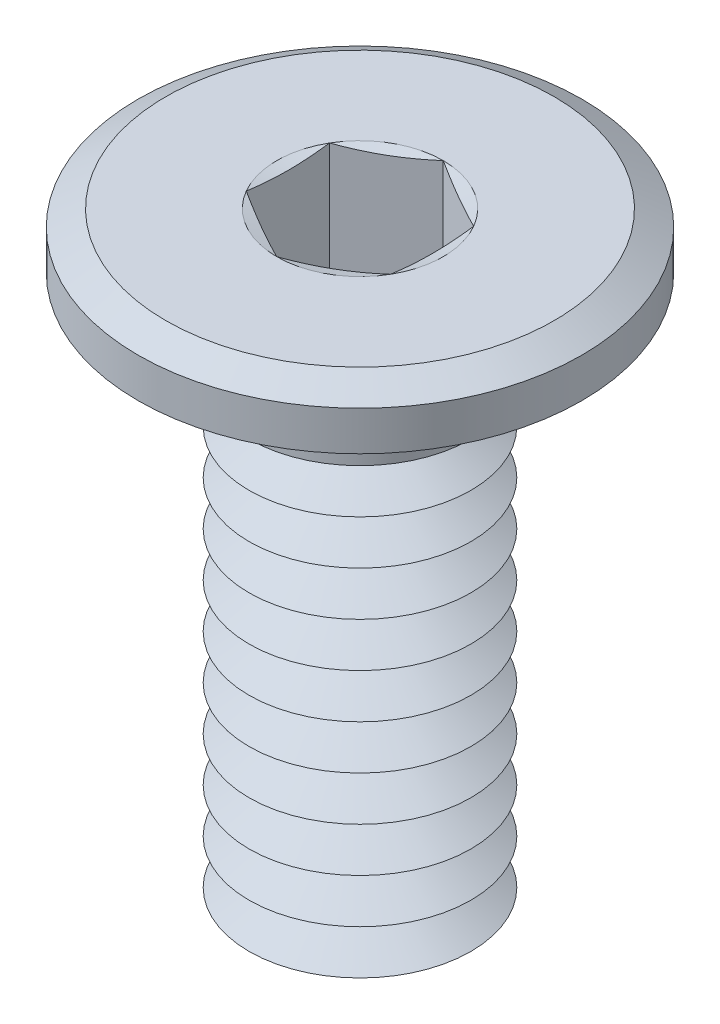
ISO-10303-21;
HEADER;
FILE_DESCRIPTION(('STEP AP214'),'2;1');
FILE_NAME('part.step','',(''),(''),'','','');
FILE_SCHEMA(('AUTOMOTIVE_DESIGN { 1 0 10303 214 1 1 1 1 }'));
ENDSEC;
DATA;
#1=APPLICATION_CONTEXT('core data for automotive mechanical design processes');
#2=APPLICATION_PROTOCOL_DEFINITION('international standard','automotive_design',2000,#1);
#3=PRODUCT_CONTEXT('',#1,'mechanical');
#4=PRODUCT('Part','Part','',(#3));
#5=PRODUCT_RELATED_PRODUCT_CATEGORY('part','',(#4));
#6=PRODUCT_DEFINITION_FORMATION('','',#4);
#7=PRODUCT_DEFINITION_CONTEXT('part definition',#1,'design');
#8=PRODUCT_DEFINITION('design','',#6,#7);
#9=PRODUCT_DEFINITION_SHAPE('','',#8);
#10=(LENGTH_UNIT() NAMED_UNIT(*) SI_UNIT(.MILLI.,.METRE.));
#11=(NAMED_UNIT(*) PLANE_ANGLE_UNIT() SI_UNIT($,.RADIAN.));
#12=(NAMED_UNIT(*) SI_UNIT($,.STERADIAN.) SOLID_ANGLE_UNIT());
#13=UNCERTAINTY_MEASURE_WITH_UNIT(LENGTH_MEASURE(1.E-05),#10,'distance_accuracy_value','');
#14=(GEOMETRIC_REPRESENTATION_CONTEXT(3) GLOBAL_UNCERTAINTY_ASSIGNED_CONTEXT((#13)) GLOBAL_UNIT_ASSIGNED_CONTEXT((#10,
#11,#12)) REPRESENTATION_CONTEXT('',''));
#15=CARTESIAN_POINT('',(0.,0.,0.));
#16=DIRECTION('',(0.,0.,1.));
#17=DIRECTION('',(1.,0.,0.));
#18=AXIS2_PLACEMENT_3D('',#15,#16,#17);
#19=CARTESIAN_POINT('',(0.,-4.9,0.));
#20=DIRECTION('',(0.,-1.,0.));
#21=DIRECTION('',(0.,0.,-1.));
#22=AXIS2_PLACEMENT_3D('',#19,#20,#21);
#23=CONICAL_SURFACE('',#22,1.,1.0471975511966);
#24=CARTESIAN_POINT('',(0.,-4.7,0.));
#25=DIRECTION('',(0.,1.,0.));
#26=DIRECTION('',(0.,0.,1.));
#27=AXIS2_PLACEMENT_3D('',#24,#25,#26);
#28=CIRCLE('',#27,0.653589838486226);
#29=CARTESIAN_POINT('',(0.,-4.7,0.653589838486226));
#30=VERTEX_POINT('',#29);
#31=EDGE_CURVE('E440',#30,#30,#28,.T.);
#32=ORIENTED_EDGE('',*,*,#31,.F.);
#33=EDGE_LOOP('',(#32));
#34=FACE_BOUND('',#33,.T.);
#35=CARTESIAN_POINT('',(0.,-4.9,0.));
#36=DIRECTION('',(0.,1.,0.));
#37=DIRECTION('',(0.,0.,1.));
#38=AXIS2_PLACEMENT_3D('',#35,#36,#37);
#39=CIRCLE('',#38,1.);
#40=CARTESIAN_POINT('',(0.,-4.9,1.));
#41=VERTEX_POINT('',#40);
#42=EDGE_CURVE('E444',#41,#41,#39,.T.);
#43=ORIENTED_EDGE('',*,*,#42,.T.);
#44=EDGE_LOOP('',(#43));
#45=FACE_BOUND('',#44,.T.);
#46=ADVANCED_FACE('F39',(#34,#45),#23,.T.);
#47=CARTESIAN_POINT('',(0.,-4.7,0.));
#48=DIRECTION('',(0.,1.,0.));
#49=DIRECTION('',(0.,0.,1.));
#50=AXIS2_PLACEMENT_3D('',#47,#48,#49);
#51=CONICAL_SURFACE('',#50,0.653589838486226,1.0471975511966);
#52=CARTESIAN_POINT('',(0.,-4.5,0.));
#53=DIRECTION('',(0.,1.,0.));
#54=DIRECTION('',(0.,0.,1.));
#55=AXIS2_PLACEMENT_3D('',#52,#53,#54);
#56=CIRCLE('',#55,1.);
#57=CARTESIAN_POINT('',(0.,-4.5,1.));
#58=VERTEX_POINT('',#57);
#59=EDGE_CURVE('E436',#58,#58,#56,.T.);
#60=ORIENTED_EDGE('',*,*,#59,.F.);
#61=EDGE_LOOP('',(#60));
#62=FACE_BOUND('',#61,.T.);
#63=ORIENTED_EDGE('',*,*,#31,.T.);
#64=EDGE_LOOP('',(#63));
#65=FACE_BOUND('',#64,.T.);
#66=ADVANCED_FACE('F233',(#62,#65),#51,.T.);
#67=CARTESIAN_POINT('',(0.,-5.5,0.));
#68=DIRECTION('',(0.,-1.,0.));
#69=DIRECTION('',(0.,0.,-1.));
#70=AXIS2_PLACEMENT_3D('',#67,#68,#69);
#71=PLANE('',#70);
#72=CARTESIAN_POINT('',(0.,-5.5,0.));
#73=DIRECTION('',(0.,1.,0.));
#74=DIRECTION('',(0.,0.,1.));
#75=AXIS2_PLACEMENT_3D('',#72,#73,#74);
#76=CIRCLE('',#75,0.653589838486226);
#77=CARTESIAN_POINT('',(0.,-5.5,0.653589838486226));
#78=VERTEX_POINT('',#77);
#79=EDGE_CURVE('E299',#78,#78,#76,.T.);
#80=ORIENTED_EDGE('',*,*,#79,.F.);
#81=EDGE_LOOP('',(#80));
#82=FACE_BOUND('',#81,.T.);
#83=ADVANCED_FACE('F239',(#82),#71,.T.);
#84=CARTESIAN_POINT('',(0.,-5.5,0.));
#85=DIRECTION('',(0.,1.,0.));
#86=DIRECTION('',(0.,0.,1.));
#87=AXIS2_PLACEMENT_3D('',#84,#85,#86);
#88=CONICAL_SURFACE('',#87,0.653589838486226,1.0471975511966);
#89=CARTESIAN_POINT('',(0.,-5.3,0.));
#90=DIRECTION('',(0.,1.,0.));
#91=DIRECTION('',(0.,0.,1.));
#92=AXIS2_PLACEMENT_3D('',#89,#90,#91);
#93=CIRCLE('',#92,1.);
#94=CARTESIAN_POINT('',(0.,-5.3,1.));
#95=VERTEX_POINT('',#94);
#96=EDGE_CURVE('E452',#95,#95,#93,.T.);
#97=ORIENTED_EDGE('',*,*,#96,.F.);
#98=EDGE_LOOP('',(#97));
#99=FACE_BOUND('',#98,.T.);
#100=ORIENTED_EDGE('',*,*,#79,.T.);
#101=EDGE_LOOP('',(#100));
#102=FACE_BOUND('',#101,.T.);
#103=ADVANCED_FACE('F254',(#99,#102),#88,.T.);
#104=CARTESIAN_POINT('',(0.,-5.3,0.));
#105=DIRECTION('',(0.,-1.,0.));
#106=DIRECTION('',(0.,0.,-1.));
#107=AXIS2_PLACEMENT_3D('',#104,#105,#106);
#108=CONICAL_SURFACE('',#107,1.,1.0471975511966);
#109=CARTESIAN_POINT('',(0.,-5.1,0.));
#110=DIRECTION('',(0.,1.,0.));
#111=DIRECTION('',(0.,0.,1.));
#112=AXIS2_PLACEMENT_3D('',#109,#110,#111);
#113=CIRCLE('',#112,0.653589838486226);
#114=CARTESIAN_POINT('',(0.,-5.1,0.653589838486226));
#115=VERTEX_POINT('',#114);
#116=EDGE_CURVE('E448',#115,#115,#113,.T.);
#117=ORIENTED_EDGE('',*,*,#116,.F.);
#118=EDGE_LOOP('',(#117));
#119=FACE_BOUND('',#118,.T.);
#120=ORIENTED_EDGE('',*,*,#96,.T.);
#121=EDGE_LOOP('',(#120));
#122=FACE_BOUND('',#121,.T.);
#123=ADVANCED_FACE('F250',(#119,#122),#108,.T.);
#124=CARTESIAN_POINT('',(0.,-5.1,0.));
#125=DIRECTION('',(0.,1.,0.));
#126=DIRECTION('',(0.,0.,1.));
#127=AXIS2_PLACEMENT_3D('',#124,#125,#126);
#128=CONICAL_SURFACE('',#127,0.653589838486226,1.0471975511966);
#129=ORIENTED_EDGE('',*,*,#42,.F.);
#130=EDGE_LOOP('',(#129));
#131=FACE_BOUND('',#130,.T.);
#132=ORIENTED_EDGE('',*,*,#116,.T.);
#133=EDGE_LOOP('',(#132));
#134=FACE_BOUND('',#133,.T.);
#135=ADVANCED_FACE('F246',(#131,#134),#128,.T.);
#136=CARTESIAN_POINT('',(0.,-4.5,0.));
#137=DIRECTION('',(0.,-1.,0.));
#138=DIRECTION('',(0.,0.,-1.));
#139=AXIS2_PLACEMENT_3D('',#136,#137,#138);
#140=CONICAL_SURFACE('',#139,1.,1.0471975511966);
#141=CARTESIAN_POINT('',(0.,-4.3,0.));
#142=DIRECTION('',(0.,1.,0.));
#143=DIRECTION('',(0.,0.,1.));
#144=AXIS2_PLACEMENT_3D('',#141,#142,#143);
#145=CIRCLE('',#144,0.653589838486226);
#146=CARTESIAN_POINT('',(0.,-4.3,0.653589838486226));
#147=VERTEX_POINT('',#146);
#148=EDGE_CURVE('E432',#147,#147,#145,.T.);
#149=ORIENTED_EDGE('',*,*,#148,.F.);
#150=EDGE_LOOP('',(#149));
#151=FACE_BOUND('',#150,.T.);
#152=ORIENTED_EDGE('',*,*,#59,.T.);
#153=EDGE_LOOP('',(#152));
#154=FACE_BOUND('',#153,.T.);
#155=ADVANCED_FACE('F249',(#151,#154),#140,.T.);
#156=CARTESIAN_POINT('',(0.,-4.3,0.));
#157=DIRECTION('',(0.,1.,0.));
#158=DIRECTION('',(0.,0.,1.));
#159=AXIS2_PLACEMENT_3D('',#156,#157,#158);
#160=CONICAL_SURFACE('',#159,0.653589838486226,1.0471975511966);
#161=CARTESIAN_POINT('',(0.,-4.1,0.));
#162=DIRECTION('',(0.,1.,0.));
#163=DIRECTION('',(0.,0.,1.));
#164=AXIS2_PLACEMENT_3D('',#161,#162,#163);
#165=CIRCLE('',#164,1.);
#166=CARTESIAN_POINT('',(0.,-4.1,1.));
#167=VERTEX_POINT('',#166);
#168=EDGE_CURVE('E428',#167,#167,#165,.T.);
#169=ORIENTED_EDGE('',*,*,#168,.F.);
#170=EDGE_LOOP('',(#169));
#171=FACE_BOUND('',#170,.T.);
#172=ORIENTED_EDGE('',*,*,#148,.T.);
#173=EDGE_LOOP('',(#172));
#174=FACE_BOUND('',#173,.T.);
#175=ADVANCED_FACE('F673',(#171,#174),#160,.T.);
#176=CARTESIAN_POINT('',(0.,-4.1,0.));
#177=DIRECTION('',(0.,-1.,0.));
#178=DIRECTION('',(0.,0.,-1.));
#179=AXIS2_PLACEMENT_3D('',#176,#177,#178);
#180=CONICAL_SURFACE('',#179,1.,1.0471975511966);
#181=CARTESIAN_POINT('',(0.,-3.9,0.));
#182=DIRECTION('',(0.,1.,0.));
#183=DIRECTION('',(0.,0.,1.));
#184=AXIS2_PLACEMENT_3D('',#181,#182,#183);
#185=CIRCLE('',#184,0.653589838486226);
#186=CARTESIAN_POINT('',(0.,-3.9,0.653589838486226));
#187=VERTEX_POINT('',#186);
#188=EDGE_CURVE('E424',#187,#187,#185,.T.);
#189=ORIENTED_EDGE('',*,*,#188,.F.);
#190=EDGE_LOOP('',(#189));
#191=FACE_BOUND('',#190,.T.);
#192=ORIENTED_EDGE('',*,*,#168,.T.);
#193=EDGE_LOOP('',(#192));
#194=FACE_BOUND('',#193,.T.);
#195=ADVANCED_FACE('F664',(#191,#194),#180,.T.);
#196=CARTESIAN_POINT('',(0.,-3.9,0.));
#197=DIRECTION('',(0.,1.,0.));
#198=DIRECTION('',(0.,0.,1.));
#199=AXIS2_PLACEMENT_3D('',#196,#197,#198);
#200=CONICAL_SURFACE('',#199,0.653589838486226,1.0471975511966);
#201=CARTESIAN_POINT('',(0.,-3.7,0.));
#202=DIRECTION('',(0.,1.,0.));
#203=DIRECTION('',(0.,0.,1.));
#204=AXIS2_PLACEMENT_3D('',#201,#202,#203);
#205=CIRCLE('',#204,1.);
#206=CARTESIAN_POINT('',(0.,-3.7,1.));
#207=VERTEX_POINT('',#206);
#208=EDGE_CURVE('E421',#207,#207,#205,.T.);
#209=ORIENTED_EDGE('',*,*,#208,.F.);
#210=EDGE_LOOP('',(#209));
#211=FACE_BOUND('',#210,.T.);
#212=ORIENTED_EDGE('',*,*,#188,.T.);
#213=EDGE_LOOP('',(#212));
#214=FACE_BOUND('',#213,.T.);
#215=ADVANCED_FACE('F655',(#211,#214),#200,.T.);
#216=CARTESIAN_POINT('',(0.,-3.7,0.));
#217=DIRECTION('',(0.,-1.,0.));
#218=DIRECTION('',(0.,0.,-1.));
#219=AXIS2_PLACEMENT_3D('',#216,#217,#218);
#220=CONICAL_SURFACE('',#219,1.,1.0471975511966);
#221=CARTESIAN_POINT('',(0.,-3.5,0.));
#222=DIRECTION('',(0.,1.,0.));
#223=DIRECTION('',(0.,0.,1.));
#224=AXIS2_PLACEMENT_3D('',#221,#222,#223);
#225=CIRCLE('',#224,0.653589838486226);
#226=CARTESIAN_POINT('',(0.,-3.5,0.653589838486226));
#227=VERTEX_POINT('',#226);
#228=EDGE_CURVE('E417',#227,#227,#225,.T.);
#229=ORIENTED_EDGE('',*,*,#228,.F.);
#230=EDGE_LOOP('',(#229));
#231=FACE_BOUND('',#230,.T.);
#232=ORIENTED_EDGE('',*,*,#208,.T.);
#233=EDGE_LOOP('',(#232));
#234=FACE_BOUND('',#233,.T.);
#235=ADVANCED_FACE('F646',(#231,#234),#220,.T.);
#236=CARTESIAN_POINT('',(0.,-3.5,0.));
#237=DIRECTION('',(0.,1.,0.));
#238=DIRECTION('',(0.,0.,1.));
#239=AXIS2_PLACEMENT_3D('',#236,#237,#238);
#240=CONICAL_SURFACE('',#239,0.653589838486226,1.0471975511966);
#241=CARTESIAN_POINT('',(0.,-3.3,0.));
#242=DIRECTION('',(0.,1.,0.));
#243=DIRECTION('',(0.,0.,1.));
#244=AXIS2_PLACEMENT_3D('',#241,#242,#243);
#245=CIRCLE('',#244,1.);
#246=CARTESIAN_POINT('',(0.,-3.3,1.));
#247=VERTEX_POINT('',#246);
#248=EDGE_CURVE('E414',#247,#247,#245,.T.);
#249=ORIENTED_EDGE('',*,*,#248,.F.);
#250=EDGE_LOOP('',(#249));
#251=FACE_BOUND('',#250,.T.);
#252=ORIENTED_EDGE('',*,*,#228,.T.);
#253=EDGE_LOOP('',(#252));
#254=FACE_BOUND('',#253,.T.);
#255=ADVANCED_FACE('F637',(#251,#254),#240,.T.);
#256=CARTESIAN_POINT('',(0.,-3.3,0.));
#257=DIRECTION('',(0.,-1.,0.));
#258=DIRECTION('',(0.,0.,-1.));
#259=AXIS2_PLACEMENT_3D('',#256,#257,#258);
#260=CONICAL_SURFACE('',#259,1.,1.0471975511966);
#261=CARTESIAN_POINT('',(0.,-3.1,0.));
#262=DIRECTION('',(0.,1.,0.));
#263=DIRECTION('',(0.,0.,1.));
#264=AXIS2_PLACEMENT_3D('',#261,#262,#263);
#265=CIRCLE('',#264,0.653589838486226);
#266=CARTESIAN_POINT('',(0.,-3.1,0.653589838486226));
#267=VERTEX_POINT('',#266);
#268=EDGE_CURVE('E410',#267,#267,#265,.T.);
#269=ORIENTED_EDGE('',*,*,#268,.F.);
#270=EDGE_LOOP('',(#269));
#271=FACE_BOUND('',#270,.T.);
#272=ORIENTED_EDGE('',*,*,#248,.T.);
#273=EDGE_LOOP('',(#272));
#274=FACE_BOUND('',#273,.T.);
#275=ADVANCED_FACE('F628',(#271,#274),#260,.T.);
#276=CARTESIAN_POINT('',(0.,-3.1,0.));
#277=DIRECTION('',(0.,1.,0.));
#278=DIRECTION('',(0.,0.,1.));
#279=AXIS2_PLACEMENT_3D('',#276,#277,#278);
#280=CONICAL_SURFACE('',#279,0.653589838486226,1.0471975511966);
#281=CARTESIAN_POINT('',(0.,-2.9,0.));
#282=DIRECTION('',(0.,1.,0.));
#283=DIRECTION('',(0.,0.,1.));
#284=AXIS2_PLACEMENT_3D('',#281,#282,#283);
#285=CIRCLE('',#284,1.);
#286=CARTESIAN_POINT('',(0.,-2.9,1.));
#287=VERTEX_POINT('',#286);
#288=EDGE_CURVE('E407',#287,#287,#285,.T.);
#289=ORIENTED_EDGE('',*,*,#288,.F.);
#290=EDGE_LOOP('',(#289));
#291=FACE_BOUND('',#290,.T.);
#292=ORIENTED_EDGE('',*,*,#268,.T.);
#293=EDGE_LOOP('',(#292));
#294=FACE_BOUND('',#293,.T.);
#295=ADVANCED_FACE('F619',(#291,#294),#280,.T.);
#296=CARTESIAN_POINT('',(0.,-2.9,0.));
#297=DIRECTION('',(0.,-1.,0.));
#298=DIRECTION('',(0.,0.,-1.));
#299=AXIS2_PLACEMENT_3D('',#296,#297,#298);
#300=CONICAL_SURFACE('',#299,1.,1.0471975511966);
#301=CARTESIAN_POINT('',(0.,-2.7,0.));
#302=DIRECTION('',(0.,1.,0.));
#303=DIRECTION('',(0.,0.,1.));
#304=AXIS2_PLACEMENT_3D('',#301,#302,#303);
#305=CIRCLE('',#304,0.653589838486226);
#306=CARTESIAN_POINT('',(0.,-2.7,0.653589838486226));
#307=VERTEX_POINT('',#306);
#308=EDGE_CURVE('E403',#307,#307,#305,.T.);
#309=ORIENTED_EDGE('',*,*,#308,.F.);
#310=EDGE_LOOP('',(#309));
#311=FACE_BOUND('',#310,.T.);
#312=ORIENTED_EDGE('',*,*,#288,.T.);
#313=EDGE_LOOP('',(#312));
#314=FACE_BOUND('',#313,.T.);
#315=ADVANCED_FACE('F610',(#311,#314),#300,.T.);
#316=CARTESIAN_POINT('',(0.,-2.7,0.));
#317=DIRECTION('',(0.,1.,0.));
#318=DIRECTION('',(0.,0.,1.));
#319=AXIS2_PLACEMENT_3D('',#316,#317,#318);
#320=CONICAL_SURFACE('',#319,0.653589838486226,1.0471975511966);
#321=CARTESIAN_POINT('',(0.,-2.5,0.));
#322=DIRECTION('',(0.,1.,0.));
#323=DIRECTION('',(0.,0.,1.));
#324=AXIS2_PLACEMENT_3D('',#321,#322,#323);
#325=CIRCLE('',#324,1.);
#326=CARTESIAN_POINT('',(0.,-2.5,1.));
#327=VERTEX_POINT('',#326);
#328=EDGE_CURVE('E399',#327,#327,#325,.T.);
#329=ORIENTED_EDGE('',*,*,#328,.F.);
#330=EDGE_LOOP('',(#329));
#331=FACE_BOUND('',#330,.T.);
#332=ORIENTED_EDGE('',*,*,#308,.T.);
#333=EDGE_LOOP('',(#332));
#334=FACE_BOUND('',#333,.T.);
#335=ADVANCED_FACE('F601',(#331,#334),#320,.T.);
#336=CARTESIAN_POINT('',(0.,-2.5,0.));
#337=DIRECTION('',(0.,-1.,0.));
#338=DIRECTION('',(0.,0.,-1.));
#339=AXIS2_PLACEMENT_3D('',#336,#337,#338);
#340=CONICAL_SURFACE('',#339,1.,1.0471975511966);
#341=CARTESIAN_POINT('',(0.,-2.3,0.));
#342=DIRECTION('',(0.,1.,0.));
#343=DIRECTION('',(0.,0.,1.));
#344=AXIS2_PLACEMENT_3D('',#341,#342,#343);
#345=CIRCLE('',#344,0.653589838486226);
#346=CARTESIAN_POINT('',(0.,-2.3,0.653589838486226));
#347=VERTEX_POINT('',#346);
#348=EDGE_CURVE('E396',#347,#347,#345,.T.);
#349=ORIENTED_EDGE('',*,*,#348,.F.);
#350=EDGE_LOOP('',(#349));
#351=FACE_BOUND('',#350,.T.);
#352=ORIENTED_EDGE('',*,*,#328,.T.);
#353=EDGE_LOOP('',(#352));
#354=FACE_BOUND('',#353,.T.);
#355=ADVANCED_FACE('F592',(#351,#354),#340,.T.);
#356=CARTESIAN_POINT('',(0.,-2.3,0.));
#357=DIRECTION('',(0.,1.,0.));
#358=DIRECTION('',(0.,0.,1.));
#359=AXIS2_PLACEMENT_3D('',#356,#357,#358);
#360=CONICAL_SURFACE('',#359,0.653589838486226,1.0471975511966);
#361=CARTESIAN_POINT('',(0.,-2.1,0.));
#362=DIRECTION('',(0.,1.,0.));
#363=DIRECTION('',(0.,0.,1.));
#364=AXIS2_PLACEMENT_3D('',#361,#362,#363);
#365=CIRCLE('',#364,1.);
#366=CARTESIAN_POINT('',(0.,-2.1,1.));
#367=VERTEX_POINT('',#366);
#368=EDGE_CURVE('E393',#367,#367,#365,.T.);
#369=ORIENTED_EDGE('',*,*,#368,.F.);
#370=EDGE_LOOP('',(#369));
#371=FACE_BOUND('',#370,.T.);
#372=ORIENTED_EDGE('',*,*,#348,.T.);
#373=EDGE_LOOP('',(#372));
#374=FACE_BOUND('',#373,.T.);
#375=ADVANCED_FACE('F583',(#371,#374),#360,.T.);
#376=CARTESIAN_POINT('',(0.,-2.1,0.));
#377=DIRECTION('',(0.,-1.,0.));
#378=DIRECTION('',(0.,0.,-1.));
#379=AXIS2_PLACEMENT_3D('',#376,#377,#378);
#380=CONICAL_SURFACE('',#379,1.,1.0471975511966);
#381=CARTESIAN_POINT('',(0.,-1.9,0.));
#382=DIRECTION('',(0.,1.,0.));
#383=DIRECTION('',(0.,0.,1.));
#384=AXIS2_PLACEMENT_3D('',#381,#382,#383);
#385=CIRCLE('',#384,0.653589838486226);
#386=CARTESIAN_POINT('',(0.,-1.9,0.653589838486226));
#387=VERTEX_POINT('',#386);
#388=EDGE_CURVE('E389',#387,#387,#385,.T.);
#389=ORIENTED_EDGE('',*,*,#388,.F.);
#390=EDGE_LOOP('',(#389));
#391=FACE_BOUND('',#390,.T.);
#392=ORIENTED_EDGE('',*,*,#368,.T.);
#393=EDGE_LOOP('',(#392));
#394=FACE_BOUND('',#393,.T.);
#395=ADVANCED_FACE('F574',(#391,#394),#380,.T.);
#396=CARTESIAN_POINT('',(0.,-1.9,0.));
#397=DIRECTION('',(0.,1.,0.));
#398=DIRECTION('',(0.,0.,1.));
#399=AXIS2_PLACEMENT_3D('',#396,#397,#398);
#400=CONICAL_SURFACE('',#399,0.653589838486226,1.0471975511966);
#401=CARTESIAN_POINT('',(0.,-1.7,0.));
#402=DIRECTION('',(0.,1.,0.));
#403=DIRECTION('',(0.,0.,1.));
#404=AXIS2_PLACEMENT_3D('',#401,#402,#403);
#405=CIRCLE('',#404,1.);
#406=CARTESIAN_POINT('',(0.,-1.7,1.));
#407=VERTEX_POINT('',#406);
#408=EDGE_CURVE('E385',#407,#407,#405,.T.);
#409=ORIENTED_EDGE('',*,*,#408,.F.);
#410=EDGE_LOOP('',(#409));
#411=FACE_BOUND('',#410,.T.);
#412=ORIENTED_EDGE('',*,*,#388,.T.);
#413=EDGE_LOOP('',(#412));
#414=FACE_BOUND('',#413,.T.);
#415=ADVANCED_FACE('F565',(#411,#414),#400,.T.);
#416=CARTESIAN_POINT('',(0.,-1.7,0.));
#417=DIRECTION('',(0.,-1.,0.));
#418=DIRECTION('',(0.,0.,-1.));
#419=AXIS2_PLACEMENT_3D('',#416,#417,#418);
#420=CONICAL_SURFACE('',#419,1.,1.0471975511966);
#421=CARTESIAN_POINT('',(0.,-1.5,0.));
#422=DIRECTION('',(0.,1.,0.));
#423=DIRECTION('',(0.,0.,1.));
#424=AXIS2_PLACEMENT_3D('',#421,#422,#423);
#425=CIRCLE('',#424,0.653589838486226);
#426=CARTESIAN_POINT('',(0.,-1.5,0.653589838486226));
#427=VERTEX_POINT('',#426);
#428=EDGE_CURVE('E381',#427,#427,#425,.T.);
#429=ORIENTED_EDGE('',*,*,#428,.F.);
#430=EDGE_LOOP('',(#429));
#431=FACE_BOUND('',#430,.T.);
#432=ORIENTED_EDGE('',*,*,#408,.T.);
#433=EDGE_LOOP('',(#432));
#434=FACE_BOUND('',#433,.T.);
#435=ADVANCED_FACE('F556',(#431,#434),#420,.T.);
#436=CARTESIAN_POINT('',(0.,-1.5,0.));
#437=DIRECTION('',(0.,1.,0.));
#438=DIRECTION('',(0.,0.,1.));
#439=AXIS2_PLACEMENT_3D('',#436,#437,#438);
#440=CONICAL_SURFACE('',#439,0.653589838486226,1.0471975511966);
#441=CARTESIAN_POINT('',(0.,-1.3,0.));
#442=DIRECTION('',(0.,1.,0.));
#443=DIRECTION('',(0.,0.,1.));
#444=AXIS2_PLACEMENT_3D('',#441,#442,#443);
#445=CIRCLE('',#444,1.);
#446=CARTESIAN_POINT('',(0.,-1.3,1.));
#447=VERTEX_POINT('',#446);
#448=EDGE_CURVE('E366',#447,#447,#445,.T.);
#449=ORIENTED_EDGE('',*,*,#448,.F.);
#450=EDGE_LOOP('',(#449));
#451=FACE_BOUND('',#450,.T.);
#452=ORIENTED_EDGE('',*,*,#428,.T.);
#453=EDGE_LOOP('',(#452));
#454=FACE_BOUND('',#453,.T.);
#455=ADVANCED_FACE('F274',(#451,#454),#440,.T.);
#456=CARTESIAN_POINT('',(0.,0.,0.));
#457=DIRECTION('',(0.,1.,0.));
#458=DIRECTION('',(0.,0.,1.));
#459=AXIS2_PLACEMENT_3D('',#456,#457,#458);
#460=PLANE('',#459);
#461=CARTESIAN_POINT('',(0.,0.,0.));
#462=DIRECTION('',(0.,1.,0.));
#463=DIRECTION('',(0.,0.,1.));
#464=AXIS2_PLACEMENT_3D('',#461,#462,#463);
#465=CIRCLE('',#464,0.750555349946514);
#466=CARTESIAN_POINT('',(0.,0.,0.750555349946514));
#467=VERTEX_POINT('',#466);
#468=CARTESIAN_POINT('',(0.65,0.,0.375277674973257));
#469=VERTEX_POINT('',#468);
#470=EDGE_CURVE('E66',#467,#469,#465,.T.);
#471=ORIENTED_EDGE('',*,*,#470,.F.);
#472=CARTESIAN_POINT('',(-0.65,0.,0.375277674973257));
#473=VERTEX_POINT('',#472);
#474=EDGE_CURVE('E169',#473,#467,#465,.T.);
#475=ORIENTED_EDGE('',*,*,#474,.F.);
#476=CARTESIAN_POINT('',(-0.65,0.,-0.375277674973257));
#477=VERTEX_POINT('',#476);
#478=EDGE_CURVE('E164',#477,#473,#465,.T.);
#479=ORIENTED_EDGE('',*,*,#478,.F.);
#480=CARTESIAN_POINT('',(0.,0.,-0.750555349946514));
#481=VERTEX_POINT('',#480);
#482=EDGE_CURVE('E128',#481,#477,#465,.T.);
#483=ORIENTED_EDGE('',*,*,#482,.F.);
#484=CARTESIAN_POINT('',(0.65,0.,-0.375277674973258));
#485=VERTEX_POINT('',#484);
#486=EDGE_CURVE('E119',#485,#481,#465,.T.);
#487=ORIENTED_EDGE('',*,*,#486,.F.);
#488=EDGE_CURVE('E59',#469,#485,#465,.T.);
#489=ORIENTED_EDGE('',*,*,#488,.F.);
#490=EDGE_LOOP('',(#471,#475,#479,#483,#487,#489));
#491=FACE_BOUND('',#490,.T.);
#492=CARTESIAN_POINT('',(0.,0.,0.));
#493=DIRECTION('',(0.,1.,0.));
#494=DIRECTION('',(0.,0.,1.));
#495=AXIS2_PLACEMENT_3D('',#492,#493,#494);
#496=CIRCLE('',#495,1.75);
#497=CARTESIAN_POINT('',(0.,0.,1.75));
#498=VERTEX_POINT('',#497);
#499=EDGE_CURVE('E295',#498,#498,#496,.T.);
#500=ORIENTED_EDGE('',*,*,#499,.T.);
#501=EDGE_LOOP('',(#500));
#502=FACE_BOUND('',#501,.T.);
#503=ADVANCED_FACE('F160',(#491,#502),#460,.T.);
#504=CARTESIAN_POINT('',(0.,-0.5,0.));
#505=DIRECTION('',(0.,1.,0.));
#506=DIRECTION('',(0.,0.,1.));
#507=AXIS2_PLACEMENT_3D('',#504,#505,#506);
#508=CYLINDRICAL_SURFACE('',#507,2.);
#509=CARTESIAN_POINT('',(0.,-0.144337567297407,0.));
#510=DIRECTION('',(0.,1.,0.));
#511=DIRECTION('',(0.,0.,1.));
#512=AXIS2_PLACEMENT_3D('',#509,#510,#511);
#513=CIRCLE('',#512,2.);
#514=CARTESIAN_POINT('',(0.,-0.144337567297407,2.));
#515=VERTEX_POINT('',#514);
#516=EDGE_CURVE('E306',#515,#515,#513,.F.);
#517=ORIENTED_EDGE('',*,*,#516,.T.);
#518=EDGE_LOOP('',(#517));
#519=FACE_BOUND('',#518,.T.);
#520=CARTESIAN_POINT('',(0.,-0.5,0.));
#521=DIRECTION('',(0.,1.,0.));
#522=DIRECTION('',(0.,0.,1.));
#523=AXIS2_PLACEMENT_3D('',#520,#521,#522);
#524=CIRCLE('',#523,2.);
#525=CARTESIAN_POINT('',(0.,-0.5,2.));
#526=VERTEX_POINT('',#525);
#527=EDGE_CURVE('E291',#526,#526,#524,.T.);
#528=ORIENTED_EDGE('',*,*,#527,.T.);
#529=EDGE_LOOP('',(#528));
#530=FACE_BOUND('',#529,.T.);
#531=ADVANCED_FACE('F270',(#519,#530),#508,.T.);
#532=CARTESIAN_POINT('',(0.,-0.5,0.));
#533=DIRECTION('',(0.,1.,0.));
#534=DIRECTION('',(0.,0.,1.));
#535=AXIS2_PLACEMENT_3D('',#532,#533,#534);
#536=PLANE('',#535);
#537=CARTESIAN_POINT('',(0.,-0.5,0.));
#538=DIRECTION('',(0.,1.,0.));
#539=DIRECTION('',(0.,0.,1.));
#540=AXIS2_PLACEMENT_3D('',#537,#538,#539);
#541=CIRCLE('',#540,1.1);
#542=CARTESIAN_POINT('',(0.,-0.5,1.1));
#543=VERTEX_POINT('',#542);
#544=EDGE_CURVE('E286',#543,#543,#541,.T.);
#545=ORIENTED_EDGE('',*,*,#544,.T.);
#546=EDGE_LOOP('',(#545));
#547=FACE_BOUND('',#546,.T.);
#548=ORIENTED_EDGE('',*,*,#527,.F.);
#549=EDGE_LOOP('',(#548));
#550=FACE_BOUND('',#549,.T.);
#551=ADVANCED_FACE('F266',(#547,#550),#536,.F.);
#552=CARTESIAN_POINT('',(0.,-5.5,0.));
#553=DIRECTION('',(0.,1.,0.));
#554=DIRECTION('',(0.,0.,1.));
#555=AXIS2_PLACEMENT_3D('',#552,#553,#554);
#556=CYLINDRICAL_SURFACE('',#555,1.);
#557=CARTESIAN_POINT('',(0.,-0.6,0.));
#558=DIRECTION('',(0.,1.,0.));
#559=DIRECTION('',(0.,0.,1.));
#560=AXIS2_PLACEMENT_3D('',#557,#558,#559);
#561=CIRCLE('',#560,1.);
#562=CARTESIAN_POINT('',(0.,-0.6,1.));
#563=VERTEX_POINT('',#562);
#564=EDGE_CURVE('E289',#563,#563,#561,.F.);
#565=ORIENTED_EDGE('',*,*,#564,.T.);
#566=EDGE_LOOP('',(#565));
#567=FACE_BOUND('',#566,.T.);
#568=ORIENTED_EDGE('',*,*,#448,.T.);
#569=EDGE_LOOP('',(#568));
#570=FACE_BOUND('',#569,.T.);
#571=ADVANCED_FACE('F262',(#567,#570),#556,.T.);
#572=CARTESIAN_POINT('',(0.,-0.6,0.));
#573=DIRECTION('',(0.,1.,0.));
#574=DIRECTION('',(0.,0.,1.));
#575=AXIS2_PLACEMENT_3D('',#572,#573,#574);
#576=TOROIDAL_SURFACE('',#575,1.1,0.1);
#577=ORIENTED_EDGE('',*,*,#544,.F.);
#578=EDGE_LOOP('',(#577));
#579=FACE_BOUND('',#578,.T.);
#580=ORIENTED_EDGE('',*,*,#564,.F.);
#581=EDGE_LOOP('',(#580));
#582=FACE_BOUND('',#581,.T.);
#583=ADVANCED_FACE('F265',(#579,#582),#576,.F.);
#584=CARTESIAN_POINT('',(0.,0.,0.));
#585=DIRECTION('',(0.,-1.,0.));
#586=DIRECTION('',(0.,0.,-1.));
#587=AXIS2_PLACEMENT_3D('',#584,#585,#586);
#588=CONICAL_SURFACE('',#587,1.75,1.0471975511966);
#589=ORIENTED_EDGE('',*,*,#516,.F.);
#590=EDGE_LOOP('',(#589));
#591=FACE_BOUND('',#590,.T.);
#592=ORIENTED_EDGE('',*,*,#499,.F.);
#593=EDGE_LOOP('',(#592));
#594=FACE_BOUND('',#593,.T.);
#595=ADVANCED_FACE('F41',(#591,#594),#588,.T.);
#596=CARTESIAN_POINT('',(0.,0.,0.));
#597=DIRECTION('',(0.,1.,0.));
#598=DIRECTION('',(0.,0.,1.));
#599=AXIS2_PLACEMENT_3D('',#596,#597,#598);
#600=CONICAL_SURFACE('',#599,0.750555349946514,1.30899693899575);
#601=ORIENTED_EDGE('',*,*,#482,.T.);
#602=CARTESIAN_POINT('',(0.000200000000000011,3.09472466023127E-05,-0.750670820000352));
#603=CARTESIAN_POINT('',(-0.0268094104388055,-0.00415092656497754,-0.735076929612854));
#604=CARTESIAN_POINT('',(-0.0538678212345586,-0.00794750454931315,-0.719454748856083));
#605=CARTESIAN_POINT('',(-0.108080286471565,-0.0146178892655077,-0.688155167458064));
#606=CARTESIAN_POINT('',(-0.135234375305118,-0.0174913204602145,-0.672477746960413));
#607=CARTESIAN_POINT('',(-0.18947340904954,-0.0221475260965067,-0.641162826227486));
#608=CARTESIAN_POINT('',(-0.216557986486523,-0.0239358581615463,-0.625525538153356));
#609=CARTESIAN_POINT('',(-0.270761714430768,-0.0263338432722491,-0.594231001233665));
#610=CARTESIAN_POINT('',(-0.297880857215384,-0.0269437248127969,-0.578573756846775));
#611=CARTESIAN_POINT('',(-0.352119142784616,-0.0269437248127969,-0.547259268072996));
#612=CARTESIAN_POINT('',(-0.379238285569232,-0.0263338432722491,-0.531602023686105));
#613=CARTESIAN_POINT('',(-0.433442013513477,-0.0239358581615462,-0.500307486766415));
#614=CARTESIAN_POINT('',(-0.460526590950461,-0.0221475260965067,-0.484670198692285));
#615=CARTESIAN_POINT('',(-0.514765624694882,-0.0174913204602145,-0.453355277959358));
#616=CARTESIAN_POINT('',(-0.541919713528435,-0.0146178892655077,-0.437677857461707));
#617=CARTESIAN_POINT('',(-0.596132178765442,-0.00794750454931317,-0.406378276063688));
#618=CARTESIAN_POINT('',(-0.623190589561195,-0.00415092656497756,-0.390756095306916));
#619=CARTESIAN_POINT('',(-0.6502,3.09472466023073E-05,-0.375162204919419));
#620=B_SPLINE_CURVE_WITH_KNOTS('',3,(#602,#603,#604,#605,#606,#607,#608,#609,#610,#611,#612,
#613,#614,#615,#616,#617,#618,#619),.UNSPECIFIED.,.F.,.F.,(4,2,2,2,2,2,2,2,4),(0.,
0.0944056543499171,0.188849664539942,0.282805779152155,0.376743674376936,0.470681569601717,
0.564637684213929,0.659081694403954,0.753487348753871),.UNSPECIFIED.);
#621=EDGE_CURVE('E11',#481,#477,#620,.T.);
#622=ORIENTED_EDGE('',*,*,#621,.F.);
#623=EDGE_LOOP('',(#601,#622));
#624=FACE_BOUND('',#623,.T.);
#625=ADVANCED_FACE('F132',(#624),#600,.F.);
#626=ORIENTED_EDGE('',*,*,#478,.T.);
#627=CARTESIAN_POINT('',(-0.65,0.153431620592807,-1.15250975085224));
#628=CARTESIAN_POINT('',(-0.65,0.140485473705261,-1.09696292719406));
#629=CARTESIAN_POINT('',(-0.65,0.12772104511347,-1.04137089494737));
#630=CARTESIAN_POINT('',(-0.65,0.102806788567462,-0.93003898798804));
#631=CARTESIAN_POINT('',(-0.65,0.0906570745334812,-0.874299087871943));
#632=CARTESIAN_POINT('',(-0.65,0.0671143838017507,-0.762091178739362));
#633=CARTESIAN_POINT('',(-0.65,0.0557299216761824,-0.70562136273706));
#634=CARTESIAN_POINT('',(-0.65,0.0342960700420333,-0.59241870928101));
#635=CARTESIAN_POINT('',(-0.65,0.0242468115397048,-0.535685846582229));
#636=CARTESIAN_POINT('',(-0.65,0.00641278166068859,-0.423455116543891));
#637=CARTESIAN_POINT('',(-0.65,-0.00142665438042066,-0.367966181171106));
#638=CARTESIAN_POINT('',(-0.65,-0.0143371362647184,-0.256669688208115));
#639=CARTESIAN_POINT('',(-0.65,-0.0194090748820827,-0.200862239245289));
#640=CARTESIAN_POINT('',(-0.65,-0.025908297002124,-0.0892782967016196));
#641=CARTESIAN_POINT('',(-0.65,-0.0273521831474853,-0.0335028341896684));
#642=CARTESIAN_POINT('',(-0.65,-0.0263311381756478,0.078014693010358));
#643=CARTESIAN_POINT('',(-0.65,-0.0238659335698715,0.133756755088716));
#644=CARTESIAN_POINT('',(-0.65,-0.016691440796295,0.229596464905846));
#645=CARTESIAN_POINT('',(-0.65,-0.0127907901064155,0.269759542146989));
#646=CARTESIAN_POINT('',(-0.65,-0.00354681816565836,0.349915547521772));
#647=CARTESIAN_POINT('',(-0.65,0.00179646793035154,0.389908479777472));
#648=CARTESIAN_POINT('',(-0.65,0.0195190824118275,0.50990254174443));
#649=CARTESIAN_POINT('',(-0.65,0.0335668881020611,0.589653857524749));
#650=CARTESIAN_POINT('',(-0.65,0.0566589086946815,0.709742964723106));
#651=CARTESIAN_POINT('',(-0.65,0.0647873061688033,0.750268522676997));
#652=CARTESIAN_POINT('',(-0.65,0.0815416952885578,0.831218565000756));
#653=CARTESIAN_POINT('',(-0.65,0.0901676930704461,0.871643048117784));
#654=CARTESIAN_POINT('',(-0.65,0.107740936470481,0.952178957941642));
#655=CARTESIAN_POINT('',(-0.65,0.116686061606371,0.992290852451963));
#656=CARTESIAN_POINT('',(-0.65,0.134863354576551,1.07244661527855));
#657=CARTESIAN_POINT('',(-0.65,0.144095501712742,1.11249048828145));
#658=CARTESIAN_POINT('',(-0.65,0.153431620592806,1.15250975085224));
#659=B_SPLINE_CURVE_WITH_KNOTS('',3,(#627,#628,#629,#630,#631,#632,#633,#634,#635,#636,#637,
#638,#639,#640,#641,#642,#643,#644,#645,#646,#647,#648,#649,#650,#651,#652,#653,#654,#655,#656,
#657,#658),.UNSPECIFIED.,.F.,.F.,(4,2,2,2,2,2,2,2,2,2,2,2,2,2,2,4),(0.,0.171110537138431,
0.342252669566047,0.515060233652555,0.687884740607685,0.855957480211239,1.02397596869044,
1.19122416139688,1.3584840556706,1.4795115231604,1.60053604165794,1.84338230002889,
1.9673809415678,2.09138111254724,2.21467179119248,2.33795359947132),.UNSPECIFIED.);
#660=EDGE_CURVE('E172',#477,#473,#659,.T.);
#661=ORIENTED_EDGE('',*,*,#660,.F.);
#662=EDGE_LOOP('',(#626,#661));
#663=FACE_BOUND('',#662,.T.);
#664=ADVANCED_FACE('F512',(#663),#600,.F.);
#665=ORIENTED_EDGE('',*,*,#474,.T.);
#666=CARTESIAN_POINT('',(-0.6502,3.09472466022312E-05,0.375162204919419));
#667=CARTESIAN_POINT('',(-0.623190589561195,-0.0041509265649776,0.390756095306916));
#668=CARTESIAN_POINT('',(-0.596132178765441,-0.00794750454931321,0.406378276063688));
#669=CARTESIAN_POINT('',(-0.541919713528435,-0.0146178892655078,0.437677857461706));
#670=CARTESIAN_POINT('',(-0.514765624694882,-0.0174913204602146,0.453355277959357));
#671=CARTESIAN_POINT('',(-0.460526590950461,-0.0221475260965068,0.484670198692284));
#672=CARTESIAN_POINT('',(-0.433442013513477,-0.0239358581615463,0.500307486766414));
#673=CARTESIAN_POINT('',(-0.379238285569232,-0.0263338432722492,0.531602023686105));
#674=CARTESIAN_POINT('',(-0.352119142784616,-0.026943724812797,0.547259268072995));
#675=CARTESIAN_POINT('',(-0.297880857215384,-0.026943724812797,0.578573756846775));
#676=CARTESIAN_POINT('',(-0.270761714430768,-0.0263338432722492,0.594231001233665));
#677=CARTESIAN_POINT('',(-0.216557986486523,-0.0239358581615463,0.625525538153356));
#678=CARTESIAN_POINT('',(-0.18947340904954,-0.0221475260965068,0.641162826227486));
#679=CARTESIAN_POINT('',(-0.135234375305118,-0.0174913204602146,0.672477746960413));
#680=CARTESIAN_POINT('',(-0.108080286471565,-0.0146178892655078,0.688155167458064));
#681=CARTESIAN_POINT('',(-0.0538678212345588,-0.00794750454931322,0.719454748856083));
#682=CARTESIAN_POINT('',(-0.0268094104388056,-0.0041509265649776,0.735076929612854));
#683=CARTESIAN_POINT('',(0.000199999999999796,3.09472466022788E-05,0.750670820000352));
#684=B_SPLINE_CURVE_WITH_KNOTS('',3,(#666,#667,#668,#669,#670,#671,#672,#673,#674,#675,#676,
#677,#678,#679,#680,#681,#682,#683),.UNSPECIFIED.,.F.,.F.,(4,2,2,2,2,2,2,2,4),(0.,
0.0944056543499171,0.188849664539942,0.282805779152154,0.376743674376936,0.470681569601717,
0.564637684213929,0.659081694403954,0.753487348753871),.UNSPECIFIED.);
#685=EDGE_CURVE('E180',#473,#467,#684,.T.);
#686=ORIENTED_EDGE('',*,*,#685,.F.);
#687=EDGE_LOOP('',(#665,#686));
#688=FACE_BOUND('',#687,.T.);
#689=ADVANCED_FACE('F507',(#688),#600,.F.);
#690=ORIENTED_EDGE('',*,*,#470,.T.);
#691=CARTESIAN_POINT('',(-0.000200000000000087,3.09472466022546E-05,0.750670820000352));
#692=CARTESIAN_POINT('',(0.0268094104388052,-0.00415092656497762,0.735076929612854));
#693=CARTESIAN_POINT('',(0.0538678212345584,-0.00794750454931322,0.719454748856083));
#694=CARTESIAN_POINT('',(0.108080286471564,-0.0146178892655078,0.688155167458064));
#695=CARTESIAN_POINT('',(0.135234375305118,-0.0174913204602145,0.672477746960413));
#696=CARTESIAN_POINT('',(0.189473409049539,-0.0221475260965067,0.641162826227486));
#697=CARTESIAN_POINT('',(0.216557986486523,-0.0239358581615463,0.625525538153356));
#698=CARTESIAN_POINT('',(0.270761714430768,-0.0263338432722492,0.594231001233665));
#699=CARTESIAN_POINT('',(0.297880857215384,-0.0269437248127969,0.578573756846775));
#700=CARTESIAN_POINT('',(0.352119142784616,-0.0269437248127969,0.547259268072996));
#701=CARTESIAN_POINT('',(0.379238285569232,-0.0263338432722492,0.531602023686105));
#702=CARTESIAN_POINT('',(0.433442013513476,-0.0239358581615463,0.500307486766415));
#703=CARTESIAN_POINT('',(0.46052659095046,-0.0221475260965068,0.484670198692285));
#704=CARTESIAN_POINT('',(0.514765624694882,-0.0174913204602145,0.453355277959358));
#705=CARTESIAN_POINT('',(0.541919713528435,-0.0146178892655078,0.437677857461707));
#706=CARTESIAN_POINT('',(0.596132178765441,-0.00794750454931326,0.406378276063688));
#707=CARTESIAN_POINT('',(0.623190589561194,-0.00415092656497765,0.390756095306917));
#708=CARTESIAN_POINT('',(0.6502,3.09472466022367E-05,0.375162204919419));
#709=B_SPLINE_CURVE_WITH_KNOTS('',3,(#691,#692,#693,#694,#695,#696,#697,#698,#699,#700,#701,
#702,#703,#704,#705,#706,#707,#708),.UNSPECIFIED.,.F.,.F.,(4,2,2,2,2,2,2,2,4),(0.,
0.0944056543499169,0.188849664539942,0.282805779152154,0.376743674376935,0.470681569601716,
0.564637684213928,0.659081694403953,0.753487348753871),.UNSPECIFIED.);
#710=EDGE_CURVE('E199',#467,#469,#709,.T.);
#711=ORIENTED_EDGE('',*,*,#710,.F.);
#712=EDGE_LOOP('',(#690,#711));
#713=FACE_BOUND('',#712,.T.);
#714=ADVANCED_FACE('F502',(#713),#600,.F.);
#715=ORIENTED_EDGE('',*,*,#488,.T.);
#716=CARTESIAN_POINT('',(0.65,0.153431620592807,1.15250975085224));
#717=CARTESIAN_POINT('',(0.65,0.140485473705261,1.09696292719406));
#718=CARTESIAN_POINT('',(0.65,0.12772104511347,1.04137089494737));
#719=CARTESIAN_POINT('',(0.65,0.102806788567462,0.93003898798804));
#720=CARTESIAN_POINT('',(0.65,0.0906570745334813,0.874299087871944));
#721=CARTESIAN_POINT('',(0.65,0.0671143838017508,0.762091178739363));
#722=CARTESIAN_POINT('',(0.65,0.0557299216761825,0.705621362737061));
#723=CARTESIAN_POINT('',(0.65,0.0342960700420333,0.592418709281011));
#724=CARTESIAN_POINT('',(0.65,0.0242468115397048,0.53568584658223));
#725=CARTESIAN_POINT('',(0.65,0.00641278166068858,0.423455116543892));
#726=CARTESIAN_POINT('',(0.65,-0.00142665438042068,0.367966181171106));
#727=CARTESIAN_POINT('',(0.65,-0.0143371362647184,0.256669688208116));
#728=CARTESIAN_POINT('',(0.65,-0.0194090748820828,0.200862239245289));
#729=CARTESIAN_POINT('',(0.65,-0.0259082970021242,0.08927829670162));
#730=CARTESIAN_POINT('',(0.65,-0.0273521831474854,0.0335028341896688));
#731=CARTESIAN_POINT('',(0.65,-0.0263311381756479,-0.0780146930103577));
#732=CARTESIAN_POINT('',(0.65,-0.0238659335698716,-0.133756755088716));
#733=CARTESIAN_POINT('',(0.65,-0.0166914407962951,-0.229596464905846));
#734=CARTESIAN_POINT('',(0.65,-0.0127907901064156,-0.269759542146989));
#735=CARTESIAN_POINT('',(0.65,-0.00354681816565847,-0.349915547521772));
#736=CARTESIAN_POINT('',(0.65,0.00179646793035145,-0.389908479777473));
#737=CARTESIAN_POINT('',(0.65,0.0195190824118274,-0.509902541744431));
#738=CARTESIAN_POINT('',(0.649999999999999,0.033566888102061,-0.589653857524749));
#739=CARTESIAN_POINT('',(0.649999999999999,0.0566589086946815,-0.709742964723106));
#740=CARTESIAN_POINT('',(0.649999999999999,0.0647873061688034,-0.750268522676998));
#741=CARTESIAN_POINT('',(0.649999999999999,0.081541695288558,-0.831218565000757));
#742=CARTESIAN_POINT('',(0.649999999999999,0.0901676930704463,-0.871643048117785));
#743=CARTESIAN_POINT('',(0.649999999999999,0.107740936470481,-0.952178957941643));
#744=CARTESIAN_POINT('',(0.649999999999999,0.116686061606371,-0.992290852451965));
#745=CARTESIAN_POINT('',(0.649999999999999,0.134863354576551,-1.07244661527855));
#746=CARTESIAN_POINT('',(0.649999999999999,0.144095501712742,-1.11249048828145));
#747=CARTESIAN_POINT('',(0.649999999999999,0.153431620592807,-1.15250975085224));
#748=B_SPLINE_CURVE_WITH_KNOTS('',3,(#716,#717,#718,#719,#720,#721,#722,#723,#724,#725,#726,
#727,#728,#729,#730,#731,#732,#733,#734,#735,#736,#737,#738,#739,#740,#741,#742,#743,#744,#745,
#746,#747),.UNSPECIFIED.,.F.,.F.,(4,2,2,2,2,2,2,2,2,2,2,2,2,2,2,4),(0.,0.171110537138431,
0.342252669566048,0.515060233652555,0.687884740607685,0.855957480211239,1.02397596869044,
1.19122416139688,1.3584840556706,1.47951152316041,1.60053604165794,1.84338230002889,
1.9673809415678,2.09138111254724,2.21467179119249,2.33795359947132),.UNSPECIFIED.);
#749=EDGE_CURVE('E149',#469,#485,#748,.T.);
#750=ORIENTED_EDGE('',*,*,#749,.F.);
#751=EDGE_LOOP('',(#715,#750));
#752=FACE_BOUND('',#751,.T.);
#753=ADVANCED_FACE('F192',(#752),#600,.F.);
#754=ORIENTED_EDGE('',*,*,#486,.T.);
#755=CARTESIAN_POINT('',(0.6502,3.09472466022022E-05,-0.375162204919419));
#756=CARTESIAN_POINT('',(0.623190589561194,-0.00415092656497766,-0.390756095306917));
#757=CARTESIAN_POINT('',(0.596132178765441,-0.00794750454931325,-0.406378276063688));
#758=CARTESIAN_POINT('',(0.541919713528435,-0.0146178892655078,-0.437677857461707));
#759=CARTESIAN_POINT('',(0.514765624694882,-0.0174913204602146,-0.453355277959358));
#760=CARTESIAN_POINT('',(0.46052659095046,-0.0221475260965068,-0.484670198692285));
#761=CARTESIAN_POINT('',(0.433442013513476,-0.0239358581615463,-0.500307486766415));
#762=CARTESIAN_POINT('',(0.379238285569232,-0.0263338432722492,-0.531602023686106));
#763=CARTESIAN_POINT('',(0.352119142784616,-0.0269437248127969,-0.547259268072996));
#764=CARTESIAN_POINT('',(0.297880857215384,-0.0269437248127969,-0.578573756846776));
#765=CARTESIAN_POINT('',(0.270761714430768,-0.0263338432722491,-0.594231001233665));
#766=CARTESIAN_POINT('',(0.216557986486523,-0.0239358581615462,-0.625525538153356));
#767=CARTESIAN_POINT('',(0.189473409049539,-0.0221475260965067,-0.641162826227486));
#768=CARTESIAN_POINT('',(0.135234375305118,-0.0174913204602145,-0.672477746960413));
#769=CARTESIAN_POINT('',(0.108080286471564,-0.0146178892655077,-0.688155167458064));
#770=CARTESIAN_POINT('',(0.0538678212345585,-0.00794750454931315,-0.719454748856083));
#771=CARTESIAN_POINT('',(0.0268094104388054,-0.00415092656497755,-0.735076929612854));
#772=CARTESIAN_POINT('',(-0.000200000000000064,3.09472466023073E-05,-0.750670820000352));
#773=B_SPLINE_CURVE_WITH_KNOTS('',3,(#755,#756,#757,#758,#759,#760,#761,#762,#763,#764,#765,
#766,#767,#768,#769,#770,#771,#772),.UNSPECIFIED.,.F.,.F.,(4,2,2,2,2,2,2,2,4),(0.,
0.0944056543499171,0.188849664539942,0.282805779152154,0.376743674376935,0.470681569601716,
0.564637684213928,0.659081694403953,0.75348734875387),.UNSPECIFIED.);
#774=EDGE_CURVE('E123',#485,#481,#773,.T.);
#775=ORIENTED_EDGE('',*,*,#774,.F.);
#776=EDGE_LOOP('',(#754,#775));
#777=FACE_BOUND('',#776,.T.);
#778=ADVANCED_FACE('F121',(#777),#600,.F.);
#779=CARTESIAN_POINT('',(0.,-1.2,0.));
#780=DIRECTION('',(0.,1.,0.));
#781=DIRECTION('',(0.,0.,1.));
#782=AXIS2_PLACEMENT_3D('',#779,#780,#781);
#783=CONICAL_SURFACE('',#782,0.65,1.0471975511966);
#784=CARTESIAN_POINT('',(0.,-1.57527767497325,0.));
#785=VERTEX_POINT('',#784);
#786=VERTEX_LOOP('',#785);
#787=FACE_BOUND('',#786,.T.);
#788=CARTESIAN_POINT('',(0.,-1.2,0.));
#789=DIRECTION('',(0.,1.,0.));
#790=DIRECTION('',(0.,0.,1.));
#791=AXIS2_PLACEMENT_3D('',#788,#789,#790);
#792=CIRCLE('',#791,0.65);
#793=CARTESIAN_POINT('',(0.325,-1.2,0.562916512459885));
#794=VERTEX_POINT('',#793);
#795=CARTESIAN_POINT('',(0.65,-1.2,0.));
#796=VERTEX_POINT('',#795);
#797=EDGE_CURVE('E148',#794,#796,#792,.T.);
#798=ORIENTED_EDGE('',*,*,#797,.T.);
#799=CARTESIAN_POINT('',(0.,-1.2,0.));
#800=DIRECTION('',(0.,1.,0.));
#801=DIRECTION('',(0.,0.,1.));
#802=AXIS2_PLACEMENT_3D('',#799,#800,#801);
#803=CIRCLE('',#802,0.65);
#804=CARTESIAN_POINT('',(0.325,-1.2,-0.562916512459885));
#805=VERTEX_POINT('',#804);
#806=EDGE_CURVE('E53',#796,#805,#803,.T.);
#807=ORIENTED_EDGE('',*,*,#806,.T.);
#808=CARTESIAN_POINT('',(-0.325,-1.2,-0.562916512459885));
#809=VERTEX_POINT('',#808);
#810=EDGE_CURVE('E319',#805,#809,#803,.T.);
#811=ORIENTED_EDGE('',*,*,#810,.T.);
#812=CARTESIAN_POINT('',(-0.65,-1.2,0.));
#813=VERTEX_POINT('',#812);
#814=EDGE_CURVE('E318',#809,#813,#803,.T.);
#815=ORIENTED_EDGE('',*,*,#814,.T.);
#816=CARTESIAN_POINT('',(-0.325,-1.2,0.562916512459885));
#817=VERTEX_POINT('',#816);
#818=EDGE_CURVE('E311',#813,#817,#803,.T.);
#819=ORIENTED_EDGE('',*,*,#818,.T.);
#820=EDGE_CURVE('E309',#817,#794,#803,.T.);
#821=ORIENTED_EDGE('',*,*,#820,.T.);
#822=EDGE_LOOP('',(#798,#807,#811,#815,#819,#821));
#823=FACE_BOUND('',#822,.T.);
#824=ADVANCED_FACE('F191',(#787,#823),#783,.F.);
#825=CARTESIAN_POINT('',(0.,-1.2,0.));
#826=DIRECTION('',(0.,1.,0.));
#827=DIRECTION('',(0.,0.,1.));
#828=AXIS2_PLACEMENT_3D('',#825,#826,#827);
#829=PLANE('',#828);
#830=ORIENTED_EDGE('',*,*,#806,.F.);
#831=DIRECTION('',(0.,0.,-1.));
#832=VECTOR('',#831,1.);
#833=CARTESIAN_POINT('',(0.65,-1.2,0.375277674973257));
#834=LINE('',#833,#832);
#835=CARTESIAN_POINT('',(0.65,-1.2,-0.375277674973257));
#836=VERTEX_POINT('',#835);
#837=EDGE_CURVE('E360',#796,#836,#834,.T.);
#838=ORIENTED_EDGE('',*,*,#837,.T.);
#839=DIRECTION('',(-0.866025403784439,0.,-0.5));
#840=VECTOR('',#839,1.);
#841=CARTESIAN_POINT('',(0.65,-1.2,-0.375277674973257));
#842=LINE('',#841,#840);
#843=EDGE_CURVE('E461',#836,#805,#842,.T.);
#844=ORIENTED_EDGE('',*,*,#843,.T.);
#845=EDGE_LOOP('',(#830,#838,#844));
#846=FACE_BOUND('',#845,.T.);
#847=ADVANCED_FACE('F470',(#846),#829,.T.);
#848=ORIENTED_EDGE('',*,*,#797,.F.);
#849=DIRECTION('',(0.866025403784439,0.,-0.5));
#850=VECTOR('',#849,1.);
#851=CARTESIAN_POINT('',(0.,-1.2,0.750555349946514));
#852=LINE('',#851,#850);
#853=CARTESIAN_POINT('',(0.65,-1.2,0.375277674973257));
#854=VERTEX_POINT('',#853);
#855=EDGE_CURVE('E356',#794,#854,#852,.T.);
#856=ORIENTED_EDGE('',*,*,#855,.T.);
#857=EDGE_CURVE('E157',#854,#796,#834,.T.);
#858=ORIENTED_EDGE('',*,*,#857,.T.);
#859=EDGE_LOOP('',(#848,#856,#858));
#860=FACE_BOUND('',#859,.T.);
#861=ADVANCED_FACE('F473',(#860),#829,.T.);
#862=ORIENTED_EDGE('',*,*,#820,.F.);
#863=DIRECTION('',(0.866025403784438,0.,0.5));
#864=VECTOR('',#863,1.);
#865=CARTESIAN_POINT('',(-0.65,-1.2,0.375277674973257));
#866=LINE('',#865,#864);
#867=CARTESIAN_POINT('',(0.,-1.2,0.750555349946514));
#868=VERTEX_POINT('',#867);
#869=EDGE_CURVE('E347',#817,#868,#866,.T.);
#870=ORIENTED_EDGE('',*,*,#869,.T.);
#871=EDGE_CURVE('E357',#868,#794,#852,.T.);
#872=ORIENTED_EDGE('',*,*,#871,.T.);
#873=EDGE_LOOP('',(#862,#870,#872));
#874=FACE_BOUND('',#873,.T.);
#875=ADVANCED_FACE('F220',(#874),#829,.T.);
#876=ORIENTED_EDGE('',*,*,#818,.F.);
#877=DIRECTION('',(0.,0.,1.));
#878=VECTOR('',#877,1.);
#879=CARTESIAN_POINT('',(-0.65,-1.2,-0.375277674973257));
#880=LINE('',#879,#878);
#881=CARTESIAN_POINT('',(-0.65,-1.2,0.375277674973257));
#882=VERTEX_POINT('',#881);
#883=EDGE_CURVE('E335',#813,#882,#880,.T.);
#884=ORIENTED_EDGE('',*,*,#883,.T.);
#885=EDGE_CURVE('E338',#882,#817,#866,.T.);
#886=ORIENTED_EDGE('',*,*,#885,.T.);
#887=EDGE_LOOP('',(#876,#884,#886));
#888=FACE_BOUND('',#887,.T.);
#889=ADVANCED_FACE('F334',(#888),#829,.T.);
#890=ORIENTED_EDGE('',*,*,#810,.F.);
#891=CARTESIAN_POINT('',(0.,-1.2,-0.750555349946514));
#892=VERTEX_POINT('',#891);
#893=EDGE_CURVE('E463',#805,#892,#842,.T.);
#894=ORIENTED_EDGE('',*,*,#893,.T.);
#895=DIRECTION('',(-0.866025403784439,0.,0.5));
#896=VECTOR('',#895,1.);
#897=CARTESIAN_POINT('',(0.,-1.2,-0.750555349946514));
#898=LINE('',#897,#896);
#899=EDGE_CURVE('E154',#892,#809,#898,.T.);
#900=ORIENTED_EDGE('',*,*,#899,.T.);
#901=EDGE_LOOP('',(#890,#894,#900));
#902=FACE_BOUND('',#901,.T.);
#903=ADVANCED_FACE('F480',(#902),#829,.T.);
#904=ORIENTED_EDGE('',*,*,#814,.F.);
#905=CARTESIAN_POINT('',(-0.65,-1.2,-0.375277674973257));
#906=VERTEX_POINT('',#905);
#907=EDGE_CURVE('E345',#809,#906,#898,.T.);
#908=ORIENTED_EDGE('',*,*,#907,.T.);
#909=EDGE_CURVE('E340',#906,#813,#880,.T.);
#910=ORIENTED_EDGE('',*,*,#909,.T.);
#911=EDGE_LOOP('',(#904,#908,#910));
#912=FACE_BOUND('',#911,.T.);
#913=ADVANCED_FACE('F344',(#912),#829,.T.);
#914=CARTESIAN_POINT('',(0.,-1.2,-0.750555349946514));
#915=DIRECTION('',(-0.5,0.,-0.866025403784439));
#916=DIRECTION('',(-0.866025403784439,0.,0.5));
#917=AXIS2_PLACEMENT_3D('',#914,#915,#916);
#918=PLANE('',#917);
#919=DIRECTION('',(0.,1.,0.));
#920=VECTOR('',#919,1.);
#921=CARTESIAN_POINT('',(0.,-1.2,-0.750555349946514));
#922=LINE('',#921,#920);
#923=EDGE_CURVE('E142',#892,#481,#922,.T.);
#924=ORIENTED_EDGE('',*,*,#923,.T.);
#925=ORIENTED_EDGE('',*,*,#621,.T.);
#926=DIRECTION('',(0.,1.,0.));
#927=VECTOR('',#926,1.);
#928=CARTESIAN_POINT('',(-0.65,-1.2,-0.375277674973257));
#929=LINE('',#928,#927);
#930=EDGE_CURVE('E156',#906,#477,#929,.T.);
#931=ORIENTED_EDGE('',*,*,#930,.F.);
#932=ORIENTED_EDGE('',*,*,#907,.F.);
#933=ORIENTED_EDGE('',*,*,#899,.F.);
#934=EDGE_LOOP('',(#924,#925,#931,#932,#933));
#935=FACE_BOUND('',#934,.T.);
#936=ADVANCED_FACE('F151',(#935),#918,.F.);
#937=CARTESIAN_POINT('',(-0.65,-1.2,-0.375277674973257));
#938=DIRECTION('',(-1.,0.,0.));
#939=DIRECTION('',(0.,0.,1.));
#940=AXIS2_PLACEMENT_3D('',#937,#938,#939);
#941=PLANE('',#940);
#942=ORIENTED_EDGE('',*,*,#930,.T.);
#943=ORIENTED_EDGE('',*,*,#660,.T.);
#944=DIRECTION('',(0.,1.,0.));
#945=VECTOR('',#944,1.);
#946=CARTESIAN_POINT('',(-0.65,-1.2,0.375277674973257));
#947=LINE('',#946,#945);
#948=EDGE_CURVE('E341',#882,#473,#947,.T.);
#949=ORIENTED_EDGE('',*,*,#948,.F.);
#950=ORIENTED_EDGE('',*,*,#883,.F.);
#951=ORIENTED_EDGE('',*,*,#909,.F.);
#952=EDGE_LOOP('',(#942,#943,#949,#950,#951));
#953=FACE_BOUND('',#952,.T.);
#954=ADVANCED_FACE('F186',(#953),#941,.F.);
#955=CARTESIAN_POINT('',(-0.65,-1.2,0.375277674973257));
#956=DIRECTION('',(-0.5,0.,0.866025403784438));
#957=DIRECTION('',(0.866025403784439,0.,0.5));
#958=AXIS2_PLACEMENT_3D('',#955,#956,#957);
#959=PLANE('',#958);
#960=ORIENTED_EDGE('',*,*,#948,.T.);
#961=ORIENTED_EDGE('',*,*,#685,.T.);
#962=DIRECTION('',(0.,1.,0.));
#963=VECTOR('',#962,1.);
#964=CARTESIAN_POINT('',(0.,-1.2,0.750555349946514));
#965=LINE('',#964,#963);
#966=EDGE_CURVE('E371',#868,#467,#965,.T.);
#967=ORIENTED_EDGE('',*,*,#966,.F.);
#968=ORIENTED_EDGE('',*,*,#869,.F.);
#969=ORIENTED_EDGE('',*,*,#885,.F.);
#970=EDGE_LOOP('',(#960,#961,#967,#968,#969));
#971=FACE_BOUND('',#970,.T.);
#972=ADVANCED_FACE('F223',(#971),#959,.F.);
#973=CARTESIAN_POINT('',(0.,-1.2,0.750555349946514));
#974=DIRECTION('',(0.5,0.,0.866025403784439));
#975=DIRECTION('',(0.866025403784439,0.,-0.5));
#976=AXIS2_PLACEMENT_3D('',#973,#974,#975);
#977=PLANE('',#976);
#978=ORIENTED_EDGE('',*,*,#966,.T.);
#979=ORIENTED_EDGE('',*,*,#710,.T.);
#980=DIRECTION('',(0.,1.,0.));
#981=VECTOR('',#980,1.);
#982=CARTESIAN_POINT('',(0.65,-1.2,0.375277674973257));
#983=LINE('',#982,#981);
#984=EDGE_CURVE('E367',#854,#469,#983,.T.);
#985=ORIENTED_EDGE('',*,*,#984,.F.);
#986=ORIENTED_EDGE('',*,*,#855,.F.);
#987=ORIENTED_EDGE('',*,*,#871,.F.);
#988=EDGE_LOOP('',(#978,#979,#985,#986,#987));
#989=FACE_BOUND('',#988,.T.);
#990=ADVANCED_FACE('F218',(#989),#977,.F.);
#991=CARTESIAN_POINT('',(0.65,-1.2,0.375277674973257));
#992=DIRECTION('',(1.,0.,0.));
#993=DIRECTION('',(0.,0.,-1.));
#994=AXIS2_PLACEMENT_3D('',#991,#992,#993);
#995=PLANE('',#994);
#996=ORIENTED_EDGE('',*,*,#984,.T.);
#997=ORIENTED_EDGE('',*,*,#749,.T.);
#998=DIRECTION('',(0.,1.,0.));
#999=VECTOR('',#998,1.);
#1000=CARTESIAN_POINT('',(0.65,-1.2,-0.375277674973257));
#1001=LINE('',#1000,#999);
#1002=EDGE_CURVE('E146',#836,#485,#1001,.T.);
#1003=ORIENTED_EDGE('',*,*,#1002,.F.);
#1004=ORIENTED_EDGE('',*,*,#837,.F.);
#1005=ORIENTED_EDGE('',*,*,#857,.F.);
#1006=EDGE_LOOP('',(#996,#997,#1003,#1004,#1005));
#1007=FACE_BOUND('',#1006,.T.);
#1008=ADVANCED_FACE('F215',(#1007),#995,.F.);
#1009=CARTESIAN_POINT('',(0.65,-1.2,-0.375277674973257));
#1010=DIRECTION('',(0.5,0.,-0.866025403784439));
#1011=DIRECTION('',(-0.866025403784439,0.,-0.5));
#1012=AXIS2_PLACEMENT_3D('',#1009,#1010,#1011);
#1013=PLANE('',#1012);
#1014=ORIENTED_EDGE('',*,*,#1002,.T.);
#1015=ORIENTED_EDGE('',*,*,#774,.T.);
#1016=ORIENTED_EDGE('',*,*,#923,.F.);
#1017=ORIENTED_EDGE('',*,*,#893,.F.);
#1018=ORIENTED_EDGE('',*,*,#843,.F.);
#1019=EDGE_LOOP('',(#1014,#1015,#1016,#1017,#1018));
#1020=FACE_BOUND('',#1019,.T.);
#1021=ADVANCED_FACE('F140',(#1020),#1013,.F.);
#1022=CLOSED_SHELL('',(#46,#66,#83,#103,#123,#135,#155,#175,#195,#215,#235,#255,#275,#295,#315,
#335,#355,#375,#395,#415,#435,#455,#503,#531,#551,#571,#583,#595,#625,#664,#689,#714,#753,#778,
#824,#847,#861,#875,#889,#903,#913,#936,#954,#972,#990,#1008,#1021));
#1023=MANIFOLD_SOLID_BREP('B2',#1022);
#1024=ADVANCED_BREP_SHAPE_REPRESENTATION('',(#18,#1023),#14);
#1025=SHAPE_DEFINITION_REPRESENTATION(#9,#1024);
ENDSEC;
END-ISO-10303-21;
